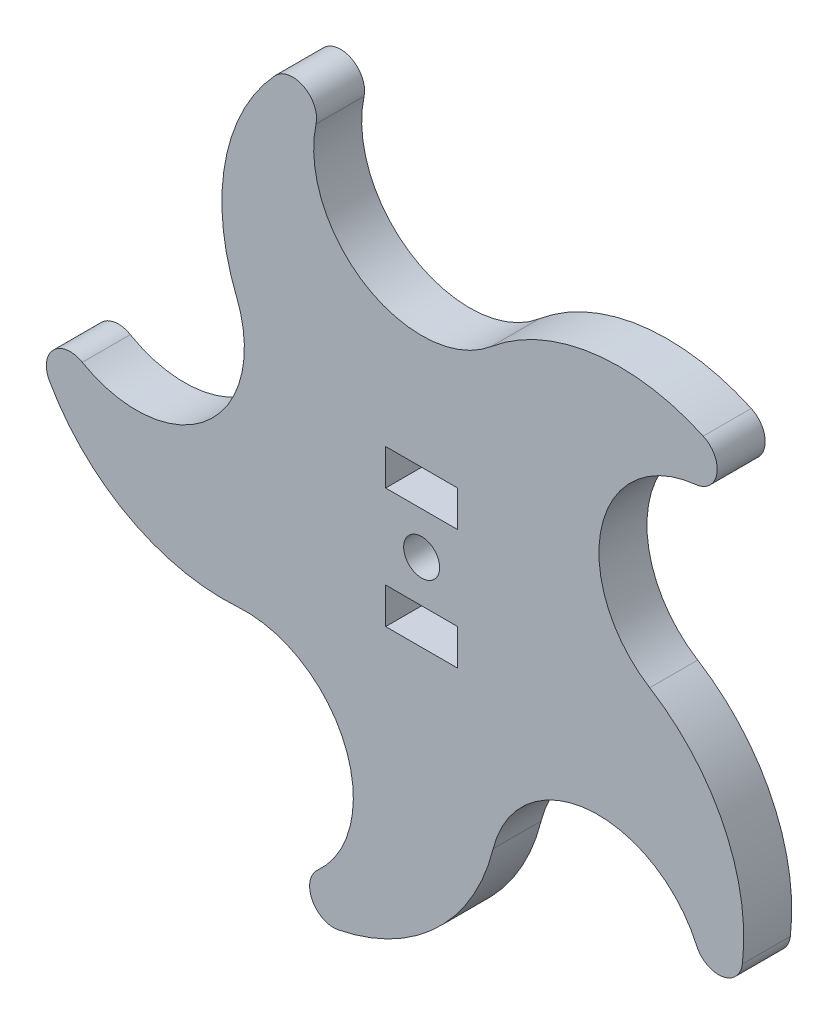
from build123d import *

# Parameters (mm, degrees)
EXTRUDE_1_DEPTH     = 4
SKETCH_3_R          = 1.5
SKETCH_3_W          = 6
SKETCH_3_H          = 3
CUT_EXTRUDE_1_DEPTH = 10


with BuildPart() as part:
    # Sketch 2 → Extrude 1 (new body)
    with BuildSketch(Plane.XY):
        with BuildLine():
            ThreePointArc((-8.67701465, -26.917830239), (-6.410026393, -16.708988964), (-15.328244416, -11.247756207))
            ThreePointArc((-15.328244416, -11.247756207), (-24.408696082, -9.291162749), (-31.027899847, -2.77433822))
            ThreePointArc((-31.027899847, -2.77433822), (-30.687341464, -0.373183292), (-28.281722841, -0.065735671))
            ThreePointArc((-28.281722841, -0.065735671), (-17.871999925, 0.932935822), (-15.433939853, 11.102278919))
            ThreePointArc((-15.433939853, 11.102278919), (-16.379122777, 20.342922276), (-12.226700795, 28.651968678))
            ThreePointArc((-12.226700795, 28.651968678), (-9.837828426, 29.070076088), (-8.802051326, 26.877203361))
            ThreePointArc((-8.802051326, 26.877203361), (-4.635477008, 17.285575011), (5.789545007, 18.109341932))
            ThreePointArc((5.789545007, 18.109341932), (14.2858415, 21.863780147), (23.471383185, 20.482228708))
            ThreePointArc((23.471383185, 20.482228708), (24.607229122, 18.33947837), (22.841755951, 16.67676087))
            ThreePointArc((22.841755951, 16.67676087), (15.00711758, 9.75013705), (19.012075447, 0.089909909))
            ThreePointArc((19.012075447, 0.089909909), (25.208258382, -6.830363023), (26.732813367, -15.993255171))
            ThreePointArc((26.732813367, -15.993255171), (25.045932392, -17.73565512), (22.919032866, -16.570398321))
            ThreePointArc((22.919032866, -16.570398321), (13.910385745, -11.259658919), (5.960563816, -18.053774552))
            ThreePointArc((5.960563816, -18.053774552), (1.293718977, -26.08517665), (-6.94959591, -30.366603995))
            ThreePointArc((-6.94959591, -30.366603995), (-9.127991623, -29.300716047), (-8.67701465, -26.917830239))
        make_face()
    extrude(amount=EXTRUDE_1_DEPTH)

    # Sketch 3 → Cut-Extrude 1 (cut)
    with BuildSketch(Plane.XY.offset(4)):
        Circle(SKETCH_3_R)
        with Locations((0, 5)):
            Rectangle(SKETCH_3_W, SKETCH_3_H)
        with Locations((0, -5)):
            Rectangle(SKETCH_3_W, SKETCH_3_H)
    extrude(amount=-CUT_EXTRUDE_1_DEPTH, mode=Mode.SUBTRACT)


solid = part.part
